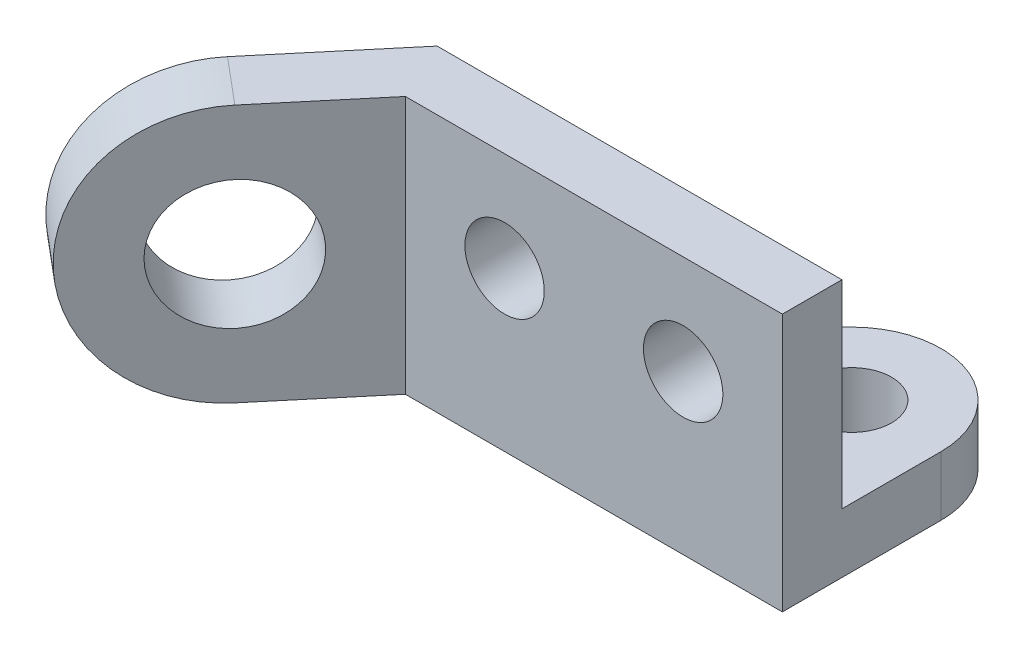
ISO-10303-21;
HEADER;
FILE_DESCRIPTION(('STEP AP214'),'2;1');
FILE_NAME('part.step','',(''),(''),'','','');
FILE_SCHEMA(('AUTOMOTIVE_DESIGN { 1 0 10303 214 1 1 1 1 }'));
ENDSEC;
DATA;
#1=APPLICATION_CONTEXT('core data for automotive mechanical design processes');
#2=APPLICATION_PROTOCOL_DEFINITION('international standard','automotive_design',2000,#1);
#3=PRODUCT_CONTEXT('',#1,'mechanical');
#4=PRODUCT('Part','Part','',(#3));
#5=PRODUCT_RELATED_PRODUCT_CATEGORY('part','',(#4));
#6=PRODUCT_DEFINITION_FORMATION('','',#4);
#7=PRODUCT_DEFINITION_CONTEXT('part definition',#1,'design');
#8=PRODUCT_DEFINITION('design','',#6,#7);
#9=PRODUCT_DEFINITION_SHAPE('','',#8);
#10=(LENGTH_UNIT() NAMED_UNIT(*) SI_UNIT(.MILLI.,.METRE.));
#11=(NAMED_UNIT(*) PLANE_ANGLE_UNIT() SI_UNIT($,.RADIAN.));
#12=(NAMED_UNIT(*) SI_UNIT($,.STERADIAN.) SOLID_ANGLE_UNIT());
#13=UNCERTAINTY_MEASURE_WITH_UNIT(LENGTH_MEASURE(1.E-05),#10,'distance_accuracy_value','');
#14=(GEOMETRIC_REPRESENTATION_CONTEXT(3) GLOBAL_UNCERTAINTY_ASSIGNED_CONTEXT((#13)) GLOBAL_UNIT_ASSIGNED_CONTEXT((#10,
#11,#12)) REPRESENTATION_CONTEXT('',''));
#15=CARTESIAN_POINT('',(0.,0.,0.));
#16=DIRECTION('',(0.,0.,1.));
#17=DIRECTION('',(1.,0.,0.));
#18=AXIS2_PLACEMENT_3D('',#15,#16,#17);
#19=CARTESIAN_POINT('',(0.,26.,-6.));
#20=DIRECTION('',(0.,0.,1.));
#21=DIRECTION('',(1.,0.,0.));
#22=AXIS2_PLACEMENT_3D('',#19,#20,#21);
#23=PLANE('',#22);
#24=CARTESIAN_POINT('',(-28.,16.,-6.));
#25=DIRECTION('',(0.,0.,-1.));
#26=DIRECTION('',(-1.,0.,0.));
#27=AXIS2_PLACEMENT_3D('',#24,#25,#26);
#28=CIRCLE('',#27,4.);
#29=CARTESIAN_POINT('',(-32.,16.,-6.));
#30=VERTEX_POINT('',#29);
#31=EDGE_CURVE('E155',#30,#30,#28,.T.);
#32=ORIENTED_EDGE('',*,*,#31,.F.);
#33=EDGE_LOOP('',(#32));
#34=FACE_BOUND('',#33,.T.);
#35=CARTESIAN_POINT('',(-10.,16.,-6.));
#36=DIRECTION('',(0.,0.,-1.));
#37=DIRECTION('',(-1.,0.,0.));
#38=AXIS2_PLACEMENT_3D('',#35,#36,#37);
#39=CIRCLE('',#38,4.);
#40=CARTESIAN_POINT('',(-14.,16.,-6.));
#41=VERTEX_POINT('',#40);
#42=EDGE_CURVE('E160',#41,#41,#39,.T.);
#43=ORIENTED_EDGE('',*,*,#42,.F.);
#44=EDGE_LOOP('',(#43));
#45=FACE_BOUND('',#44,.T.);
#46=DIRECTION('',(1.,0.,0.));
#47=VECTOR('',#46,1.);
#48=CARTESIAN_POINT('',(0.,6.,-6.));
#49=LINE('',#48,#47);
#50=CARTESIAN_POINT('',(-32.,6.,-6.));
#51=VERTEX_POINT('',#50);
#52=CARTESIAN_POINT('',(0.,6.,-6.));
#53=VERTEX_POINT('',#52);
#54=EDGE_CURVE('E146',#51,#53,#49,.T.);
#55=ORIENTED_EDGE('',*,*,#54,.F.);
#56=DIRECTION('',(0.,-1.,0.));
#57=VECTOR('',#56,1.);
#58=CARTESIAN_POINT('',(-32.,6.,-6.));
#59=LINE('',#58,#57);
#60=CARTESIAN_POINT('',(-32.,0.,-6.));
#61=VERTEX_POINT('',#60);
#62=EDGE_CURVE('E162',#51,#61,#59,.T.);
#63=ORIENTED_EDGE('',*,*,#62,.T.);
#64=DIRECTION('',(-1.,0.,0.));
#65=VECTOR('',#64,1.);
#66=CARTESIAN_POINT('',(0.,0.,-6.));
#67=LINE('',#66,#65);
#68=CARTESIAN_POINT('',(-40.79784594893,0.,-6.));
#69=VERTEX_POINT('',#68);
#70=EDGE_CURVE('E204',#61,#69,#67,.T.);
#71=ORIENTED_EDGE('',*,*,#70,.T.);
#72=DIRECTION('',(0.,-1.,0.));
#73=VECTOR('',#72,1.);
#74=CARTESIAN_POINT('',(-40.79784594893,26.,-6.));
#75=LINE('',#74,#73);
#76=CARTESIAN_POINT('',(-40.79784594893,26.,-6.));
#77=VERTEX_POINT('',#76);
#78=EDGE_CURVE('E220',#77,#69,#75,.T.);
#79=ORIENTED_EDGE('',*,*,#78,.F.);
#80=DIRECTION('',(-1.,0.,0.));
#81=VECTOR('',#80,1.);
#82=CARTESIAN_POINT('',(0.,26.,-6.));
#83=LINE('',#82,#81);
#84=CARTESIAN_POINT('',(0.,26.,-6.));
#85=VERTEX_POINT('',#84);
#86=EDGE_CURVE('E98',#85,#77,#83,.T.);
#87=ORIENTED_EDGE('',*,*,#86,.F.);
#88=DIRECTION('',(0.,-1.,0.));
#89=VECTOR('',#88,1.);
#90=CARTESIAN_POINT('',(0.,26.,-6.));
#91=LINE('',#90,#89);
#92=EDGE_CURVE('E55',#85,#53,#91,.T.);
#93=ORIENTED_EDGE('',*,*,#92,.T.);
#94=EDGE_LOOP('',(#55,#63,#71,#79,#87,#93));
#95=FACE_BOUND('',#94,.T.);
#96=ADVANCED_FACE('F45',(#34,#45,#95),#23,.F.);
#97=CARTESIAN_POINT('',(0.,26.,0.));
#98=DIRECTION('',(-1.,0.,0.));
#99=DIRECTION('',(0.,0.,1.));
#100=AXIS2_PLACEMENT_3D('',#97,#98,#99);
#101=PLANE('',#100);
#102=DIRECTION('',(0.,0.,-1.));
#103=VECTOR('',#102,1.);
#104=CARTESIAN_POINT('',(0.,0.,0.));
#105=LINE('',#104,#103);
#106=CARTESIAN_POINT('',(0.,0.,0.));
#107=VERTEX_POINT('',#106);
#108=CARTESIAN_POINT('',(0.,0.,-16.));
#109=VERTEX_POINT('',#108);
#110=EDGE_CURVE('E152',#107,#109,#105,.T.);
#111=ORIENTED_EDGE('',*,*,#110,.T.);
#112=DIRECTION('',(0.,-1.,0.));
#113=VECTOR('',#112,1.);
#114=CARTESIAN_POINT('',(0.,6.,-16.));
#115=LINE('',#114,#113);
#116=CARTESIAN_POINT('',(0.,6.,-16.));
#117=VERTEX_POINT('',#116);
#118=EDGE_CURVE('E135',#117,#109,#115,.T.);
#119=ORIENTED_EDGE('',*,*,#118,.F.);
#120=DIRECTION('',(0.,0.,-1.));
#121=VECTOR('',#120,1.);
#122=CARTESIAN_POINT('',(0.,6.,-6.));
#123=LINE('',#122,#121);
#124=EDGE_CURVE('E141',#53,#117,#123,.T.);
#125=ORIENTED_EDGE('',*,*,#124,.F.);
#126=ORIENTED_EDGE('',*,*,#92,.F.);
#127=DIRECTION('',(0.,0.,-1.));
#128=VECTOR('',#127,1.);
#129=CARTESIAN_POINT('',(0.,26.,0.));
#130=LINE('',#129,#128);
#131=CARTESIAN_POINT('',(0.,26.,0.));
#132=VERTEX_POINT('',#131);
#133=EDGE_CURVE('E188',#132,#85,#130,.T.);
#134=ORIENTED_EDGE('',*,*,#133,.F.);
#135=DIRECTION('',(0.,-1.,0.));
#136=VECTOR('',#135,1.);
#137=CARTESIAN_POINT('',(0.,26.,0.));
#138=LINE('',#137,#136);
#139=EDGE_CURVE('E201',#132,#107,#138,.T.);
#140=ORIENTED_EDGE('',*,*,#139,.T.);
#141=EDGE_LOOP('',(#111,#119,#125,#126,#134,#140));
#142=FACE_BOUND('',#141,.T.);
#143=ADVANCED_FACE('F47',(#142),#101,.F.);
#144=CARTESIAN_POINT('',(-52.238080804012,26.,7.63394098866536));
#145=DIRECTION('',(0.766044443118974,0.,0.642787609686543));
#146=DIRECTION('',(0.642787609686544,0.,-0.766044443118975));
#147=AXIS2_PLACEMENT_3D('',#144,#145,#146);
#148=PLANE('',#147);
#149=CARTESIAN_POINT('',(-50.4396600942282,13.,5.4906666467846));
#150=DIRECTION('',(-0.766044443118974,0.,-0.642787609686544));
#151=DIRECTION('',(-0.642787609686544,0.,0.766044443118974));
#152=AXIS2_PLACEMENT_3D('',#149,#150,#151);
#153=CIRCLE('',#152,6.5);
#154=CARTESIAN_POINT('',(-54.6177795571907,13.,10.4699555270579));
#155=VERTEX_POINT('',#154);
#156=EDGE_CURVE('E170',#155,#155,#153,.T.);
#157=ORIENTED_EDGE('',*,*,#156,.F.);
#158=EDGE_LOOP('',(#157));
#159=FACE_BOUND('',#158,.T.);
#160=DIRECTION('',(-0.642787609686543,0.,0.766044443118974));
#161=VECTOR('',#160,1.);
#162=CARTESIAN_POINT('',(-52.238080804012,0.,7.63394098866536));
#163=LINE('',#162,#161);
#164=CARTESIAN_POINT('',(-50.4396600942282,0.,5.4906666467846));
#165=VERTEX_POINT('',#164);
#166=EDGE_CURVE('E207',#69,#165,#163,.T.);
#167=ORIENTED_EDGE('',*,*,#166,.T.);
#168=CARTESIAN_POINT('',(-50.4396600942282,13.,5.4906666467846));
#169=DIRECTION('',(-0.766044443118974,0.,-0.642787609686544));
#170=DIRECTION('',(-0.642787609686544,0.,0.766044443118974));
#171=AXIS2_PLACEMENT_3D('',#168,#169,#170);
#172=CIRCLE('',#171,13.);
#173=CARTESIAN_POINT('',(-50.4396600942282,26.,5.4906666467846));
#174=VERTEX_POINT('',#173);
#175=EDGE_CURVE('E181',#165,#174,#172,.T.);
#176=ORIENTED_EDGE('',*,*,#175,.T.);
#177=DIRECTION('',(-0.642787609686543,0.,0.766044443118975));
#178=VECTOR('',#177,1.);
#179=CARTESIAN_POINT('',(-42.5962666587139,26.,-3.85672565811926));
#180=LINE('',#179,#178);
#181=EDGE_CURVE('E193',#77,#174,#180,.T.);
#182=ORIENTED_EDGE('',*,*,#181,.F.);
#183=ORIENTED_EDGE('',*,*,#78,.T.);
#184=EDGE_LOOP('',(#167,#176,#182,#183));
#185=FACE_BOUND('',#184,.T.);
#186=ADVANCED_FACE('F257',(#159,#185),#148,.F.);
#187=CARTESIAN_POINT('',(-38.,26.,0.));
#188=DIRECTION('',(-0.766044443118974,0.,-0.642787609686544));
#189=DIRECTION('',(-0.642787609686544,0.,0.766044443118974));
#190=AXIS2_PLACEMENT_3D('',#187,#188,#189);
#191=PLANE('',#190);
#192=CARTESIAN_POINT('',(-45.8433934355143,13.,9.34739230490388));
#193=DIRECTION('',(-0.766044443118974,0.,-0.642787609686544));
#194=DIRECTION('',(-0.642787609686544,0.,0.766044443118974));
#195=AXIS2_PLACEMENT_3D('',#192,#193,#194);
#196=CIRCLE('',#195,6.5);
#197=CARTESIAN_POINT('',(-50.0215128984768,13.,14.3266811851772));
#198=VERTEX_POINT('',#197);
#199=EDGE_CURVE('E174',#198,#198,#196,.T.);
#200=ORIENTED_EDGE('',*,*,#199,.T.);
#201=EDGE_LOOP('',(#200));
#202=FACE_BOUND('',#201,.T.);
#203=DIRECTION('',(0.642787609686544,0.,-0.766044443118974));
#204=VECTOR('',#203,1.);
#205=CARTESIAN_POINT('',(-38.,26.,0.));
#206=LINE('',#205,#204);
#207=CARTESIAN_POINT('',(-45.8433934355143,26.,9.34739230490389));
#208=VERTEX_POINT('',#207);
#209=CARTESIAN_POINT('',(-38.,26.,0.));
#210=VERTEX_POINT('',#209);
#211=EDGE_CURVE('E196',#208,#210,#206,.T.);
#212=ORIENTED_EDGE('',*,*,#211,.F.);
#213=CARTESIAN_POINT('',(-45.8433934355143,13.,9.34739230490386));
#214=DIRECTION('',(-0.766044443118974,0.,-0.642787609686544));
#215=DIRECTION('',(-0.642787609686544,0.,0.766044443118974));
#216=AXIS2_PLACEMENT_3D('',#213,#214,#215);
#217=CIRCLE('',#216,13.);
#218=CARTESIAN_POINT('',(-45.8433934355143,0.,9.34739230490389));
#219=VERTEX_POINT('',#218);
#220=EDGE_CURVE('E176',#219,#208,#217,.T.);
#221=ORIENTED_EDGE('',*,*,#220,.F.);
#222=DIRECTION('',(0.642787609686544,0.,-0.766044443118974));
#223=VECTOR('',#222,1.);
#224=CARTESIAN_POINT('',(-38.,0.,0.));
#225=LINE('',#224,#223);
#226=CARTESIAN_POINT('',(-38.,0.,0.));
#227=VERTEX_POINT('',#226);
#228=EDGE_CURVE('E210',#219,#227,#225,.T.);
#229=ORIENTED_EDGE('',*,*,#228,.T.);
#230=DIRECTION('',(0.,-1.,0.));
#231=VECTOR('',#230,1.);
#232=CARTESIAN_POINT('',(-38.,26.,0.));
#233=LINE('',#232,#231);
#234=EDGE_CURVE('E217',#210,#227,#233,.T.);
#235=ORIENTED_EDGE('',*,*,#234,.F.);
#236=EDGE_LOOP('',(#212,#221,#229,#235));
#237=FACE_BOUND('',#236,.T.);
#238=ADVANCED_FACE('F263',(#202,#237),#191,.F.);
#239=CARTESIAN_POINT('',(0.,26.,0.));
#240=DIRECTION('',(0.,0.,-1.));
#241=DIRECTION('',(-1.,0.,0.));
#242=AXIS2_PLACEMENT_3D('',#239,#240,#241);
#243=PLANE('',#242);
#244=CARTESIAN_POINT('',(-10.,16.,0.));
#245=DIRECTION('',(0.,0.,-1.));
#246=DIRECTION('',(-1.,0.,0.));
#247=AXIS2_PLACEMENT_3D('',#244,#245,#246);
#248=CIRCLE('',#247,4.);
#249=CARTESIAN_POINT('',(-14.,16.,0.));
#250=VERTEX_POINT('',#249);
#251=EDGE_CURVE('E175',#250,#250,#248,.T.);
#252=ORIENTED_EDGE('',*,*,#251,.T.);
#253=EDGE_LOOP('',(#252));
#254=FACE_BOUND('',#253,.T.);
#255=CARTESIAN_POINT('',(-28.,16.,0.));
#256=DIRECTION('',(0.,0.,-1.));
#257=DIRECTION('',(-1.,0.,0.));
#258=AXIS2_PLACEMENT_3D('',#255,#256,#257);
#259=CIRCLE('',#258,4.);
#260=CARTESIAN_POINT('',(-32.,16.,0.));
#261=VERTEX_POINT('',#260);
#262=EDGE_CURVE('E168',#261,#261,#259,.T.);
#263=ORIENTED_EDGE('',*,*,#262,.T.);
#264=EDGE_LOOP('',(#263));
#265=FACE_BOUND('',#264,.T.);
#266=DIRECTION('',(1.,0.,0.));
#267=VECTOR('',#266,1.);
#268=CARTESIAN_POINT('',(0.,0.,0.));
#269=LINE('',#268,#267);
#270=EDGE_CURVE('E90',#227,#107,#269,.T.);
#271=ORIENTED_EDGE('',*,*,#270,.T.);
#272=ORIENTED_EDGE('',*,*,#139,.F.);
#273=DIRECTION('',(1.,0.,0.));
#274=VECTOR('',#273,1.);
#275=CARTESIAN_POINT('',(0.,26.,0.));
#276=LINE('',#275,#274);
#277=EDGE_CURVE('E72',#210,#132,#276,.T.);
#278=ORIENTED_EDGE('',*,*,#277,.F.);
#279=ORIENTED_EDGE('',*,*,#234,.T.);
#280=EDGE_LOOP('',(#271,#272,#278,#279));
#281=FACE_BOUND('',#280,.T.);
#282=ADVANCED_FACE('F235',(#254,#265,#281),#243,.F.);
#283=CARTESIAN_POINT('',(0.,26.,0.));
#284=DIRECTION('',(0.,1.,0.));
#285=DIRECTION('',(0.,0.,1.));
#286=AXIS2_PLACEMENT_3D('',#283,#284,#285);
#287=PLANE('',#286);
#288=DIRECTION('',(-0.766044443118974,0.,-0.642787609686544));
#289=VECTOR('',#288,1.);
#290=CARTESIAN_POINT('',(-17.8860292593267,26.,32.8064062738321));
#291=LINE('',#290,#289);
#292=EDGE_CURVE('E180',#208,#174,#291,.T.);
#293=ORIENTED_EDGE('',*,*,#292,.F.);
#294=ORIENTED_EDGE('',*,*,#211,.T.);
#295=ORIENTED_EDGE('',*,*,#277,.T.);
#296=ORIENTED_EDGE('',*,*,#133,.T.);
#297=ORIENTED_EDGE('',*,*,#86,.T.);
#298=ORIENTED_EDGE('',*,*,#181,.T.);
#299=EDGE_LOOP('',(#293,#294,#295,#296,#297,#298));
#300=FACE_BOUND('',#299,.T.);
#301=ADVANCED_FACE('F270',(#300),#287,.T.);
#302=CARTESIAN_POINT('',(0.,0.,0.));
#303=DIRECTION('',(0.,1.,0.));
#304=DIRECTION('',(0.,0.,1.));
#305=AXIS2_PLACEMENT_3D('',#302,#303,#304);
#306=PLANE('',#305);
#307=CARTESIAN_POINT('',(-9.,0.,-16.));
#308=DIRECTION('',(0.,-1.,0.));
#309=DIRECTION('',(0.,0.,-1.));
#310=AXIS2_PLACEMENT_3D('',#307,#308,#309);
#311=CIRCLE('',#310,4.);
#312=CARTESIAN_POINT('',(-9.,0.,-20.));
#313=VERTEX_POINT('',#312);
#314=EDGE_CURVE('E311',#313,#313,#311,.T.);
#315=ORIENTED_EDGE('',*,*,#314,.F.);
#316=EDGE_LOOP('',(#315));
#317=FACE_BOUND('',#316,.T.);
#318=ORIENTED_EDGE('',*,*,#228,.F.);
#319=DIRECTION('',(-0.766044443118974,0.,-0.642787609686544));
#320=VECTOR('',#319,1.);
#321=CARTESIAN_POINT('',(-23.5440780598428,0.,28.0587396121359));
#322=LINE('',#321,#320);
#323=EDGE_CURVE('E11',#219,#165,#322,.T.);
#324=ORIENTED_EDGE('',*,*,#323,.T.);
#325=ORIENTED_EDGE('',*,*,#166,.F.);
#326=ORIENTED_EDGE('',*,*,#70,.F.);
#327=DIRECTION('',(-0.712903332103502,0.,0.70126231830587));
#328=VECTOR('',#327,1.);
#329=CARTESIAN_POINT('',(-32.,0.,-6.));
#330=LINE('',#329,#328);
#331=CARTESIAN_POINT('',(-15.3113608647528,0.,-22.4161299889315));
#332=VERTEX_POINT('',#331);
#333=EDGE_CURVE('E63',#332,#61,#330,.T.);
#334=ORIENTED_EDGE('',*,*,#333,.F.);
#335=CARTESIAN_POINT('',(-9.,0.,-16.));
#336=DIRECTION('',(0.,1.,0.));
#337=DIRECTION('',(0.,0.,1.));
#338=AXIS2_PLACEMENT_3D('',#335,#336,#337);
#339=CIRCLE('',#338,9.);
#340=EDGE_CURVE('E300',#109,#332,#339,.T.);
#341=ORIENTED_EDGE('',*,*,#340,.F.);
#342=ORIENTED_EDGE('',*,*,#110,.F.);
#343=ORIENTED_EDGE('',*,*,#270,.F.);
#344=EDGE_LOOP('',(#318,#324,#325,#326,#334,#341,#342,#343));
#345=FACE_BOUND('',#344,.T.);
#346=ADVANCED_FACE('F271',(#317,#345),#306,.F.);
#347=CARTESIAN_POINT('',(-45.8433934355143,13.,9.34739230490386));
#348=DIRECTION('',(-0.766044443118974,0.,-0.642787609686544));
#349=DIRECTION('',(-0.642787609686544,0.,0.766044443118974));
#350=AXIS2_PLACEMENT_3D('',#347,#348,#349);
#351=CYLINDRICAL_SURFACE('',#350,13.);
#352=ORIENTED_EDGE('',*,*,#175,.F.);
#353=ORIENTED_EDGE('',*,*,#323,.F.);
#354=ORIENTED_EDGE('',*,*,#220,.T.);
#355=ORIENTED_EDGE('',*,*,#292,.T.);
#356=EDGE_LOOP('',(#352,#353,#354,#355));
#357=FACE_BOUND('',#356,.T.);
#358=ADVANCED_FACE('F274',(#357),#351,.T.);
#359=CARTESIAN_POINT('',(-14.0377435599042,13.,36.0355013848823));
#360=DIRECTION('',(-0.766044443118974,0.,-0.642787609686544));
#361=DIRECTION('',(-0.642787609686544,0.,0.766044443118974));
#362=AXIS2_PLACEMENT_3D('',#359,#360,#361);
#363=CYLINDRICAL_SURFACE('',#362,6.5);
#364=ORIENTED_EDGE('',*,*,#156,.T.);
#365=EDGE_LOOP('',(#364));
#366=FACE_BOUND('',#365,.T.);
#367=ORIENTED_EDGE('',*,*,#199,.F.);
#368=EDGE_LOOP('',(#367));
#369=FACE_BOUND('',#368,.T.);
#370=ADVANCED_FACE('F250',(#366,#369),#363,.F.);
#371=CARTESIAN_POINT('',(-28.,16.,19.3059700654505));
#372=DIRECTION('',(0.,0.,-1.));
#373=DIRECTION('',(-1.,0.,0.));
#374=AXIS2_PLACEMENT_3D('',#371,#372,#373);
#375=CYLINDRICAL_SURFACE('',#374,4.);
#376=ORIENTED_EDGE('',*,*,#31,.T.);
#377=EDGE_LOOP('',(#376));
#378=FACE_BOUND('',#377,.T.);
#379=ORIENTED_EDGE('',*,*,#262,.F.);
#380=EDGE_LOOP('',(#379));
#381=FACE_BOUND('',#380,.T.);
#382=ADVANCED_FACE('F240',(#378,#381),#375,.F.);
#383=CARTESIAN_POINT('',(-10.,16.,19.3059700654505));
#384=DIRECTION('',(0.,0.,-1.));
#385=DIRECTION('',(-1.,0.,0.));
#386=AXIS2_PLACEMENT_3D('',#383,#384,#385);
#387=CYLINDRICAL_SURFACE('',#386,4.);
#388=ORIENTED_EDGE('',*,*,#42,.T.);
#389=EDGE_LOOP('',(#388));
#390=FACE_BOUND('',#389,.T.);
#391=ORIENTED_EDGE('',*,*,#251,.F.);
#392=EDGE_LOOP('',(#391));
#393=FACE_BOUND('',#392,.T.);
#394=ADVANCED_FACE('F238',(#390,#393),#387,.F.);
#395=CARTESIAN_POINT('',(-9.,6.,-16.));
#396=DIRECTION('',(0.,-1.,0.));
#397=DIRECTION('',(0.,0.,-1.));
#398=AXIS2_PLACEMENT_3D('',#395,#396,#397);
#399=CYLINDRICAL_SURFACE('',#398,9.);
#400=ORIENTED_EDGE('',*,*,#340,.T.);
#401=DIRECTION('',(0.,-1.,0.));
#402=VECTOR('',#401,1.);
#403=CARTESIAN_POINT('',(-15.3113608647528,6.,-22.4161299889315));
#404=LINE('',#403,#402);
#405=CARTESIAN_POINT('',(-15.3113608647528,6.,-22.4161299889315));
#406=VERTEX_POINT('',#405);
#407=EDGE_CURVE('E136',#406,#332,#404,.T.);
#408=ORIENTED_EDGE('',*,*,#407,.F.);
#409=CARTESIAN_POINT('',(-9.,6.,-16.));
#410=DIRECTION('',(0.,1.,0.));
#411=DIRECTION('',(0.,0.,1.));
#412=AXIS2_PLACEMENT_3D('',#409,#410,#411);
#413=CIRCLE('',#412,9.);
#414=EDGE_CURVE('E131',#117,#406,#413,.T.);
#415=ORIENTED_EDGE('',*,*,#414,.F.);
#416=ORIENTED_EDGE('',*,*,#118,.T.);
#417=EDGE_LOOP('',(#400,#408,#415,#416));
#418=FACE_BOUND('',#417,.T.);
#419=ADVANCED_FACE('F133',(#418),#399,.T.);
#420=CARTESIAN_POINT('',(-32.,6.,-6.));
#421=DIRECTION('',(0.70126231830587,0.,0.712903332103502));
#422=DIRECTION('',(0.712903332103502,0.,-0.70126231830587));
#423=AXIS2_PLACEMENT_3D('',#420,#421,#422);
#424=PLANE('',#423);
#425=ORIENTED_EDGE('',*,*,#333,.T.);
#426=ORIENTED_EDGE('',*,*,#62,.F.);
#427=DIRECTION('',(-0.712903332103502,0.,0.70126231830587));
#428=VECTOR('',#427,1.);
#429=CARTESIAN_POINT('',(-32.,6.,-6.));
#430=LINE('',#429,#428);
#431=EDGE_CURVE('E140',#406,#51,#430,.T.);
#432=ORIENTED_EDGE('',*,*,#431,.F.);
#433=ORIENTED_EDGE('',*,*,#407,.T.);
#434=EDGE_LOOP('',(#425,#426,#432,#433));
#435=FACE_BOUND('',#434,.T.);
#436=ADVANCED_FACE('F248',(#435),#424,.F.);
#437=CARTESIAN_POINT('',(-9.,6.,-16.));
#438=DIRECTION('',(0.,1.,0.));
#439=DIRECTION('',(0.,0.,1.));
#440=AXIS2_PLACEMENT_3D('',#437,#438,#439);
#441=PLANE('',#440);
#442=CARTESIAN_POINT('',(-9.,6.,-16.));
#443=DIRECTION('',(0.,1.,0.));
#444=DIRECTION('',(0.,0.,1.));
#445=AXIS2_PLACEMENT_3D('',#442,#443,#444);
#446=CIRCLE('',#445,4.);
#447=CARTESIAN_POINT('',(-9.,6.,-12.));
#448=VERTEX_POINT('',#447);
#449=EDGE_CURVE('E49',#448,#448,#446,.T.);
#450=ORIENTED_EDGE('',*,*,#449,.F.);
#451=EDGE_LOOP('',(#450));
#452=FACE_BOUND('',#451,.T.);
#453=ORIENTED_EDGE('',*,*,#124,.T.);
#454=ORIENTED_EDGE('',*,*,#414,.T.);
#455=ORIENTED_EDGE('',*,*,#431,.T.);
#456=ORIENTED_EDGE('',*,*,#54,.T.);
#457=EDGE_LOOP('',(#453,#454,#455,#456));
#458=FACE_BOUND('',#457,.T.);
#459=ADVANCED_FACE('F144',(#452,#458),#441,.T.);
#460=CARTESIAN_POINT('',(-9.,26.,-16.));
#461=DIRECTION('',(0.,-1.,0.));
#462=DIRECTION('',(0.,0.,-1.));
#463=AXIS2_PLACEMENT_3D('',#460,#461,#462);
#464=CYLINDRICAL_SURFACE('',#463,4.);
#465=ORIENTED_EDGE('',*,*,#449,.T.);
#466=EDGE_LOOP('',(#465));
#467=FACE_BOUND('',#466,.T.);
#468=ORIENTED_EDGE('',*,*,#314,.T.);
#469=EDGE_LOOP('',(#468));
#470=FACE_BOUND('',#469,.T.);
#471=ADVANCED_FACE('F320',(#467,#470),#464,.F.);
#472=CLOSED_SHELL('',(#96,#143,#186,#238,#282,#301,#346,#358,#370,#382,#394,#419,#436,#459,#471));
#473=MANIFOLD_SOLID_BREP('B2',#472);
#474=ADVANCED_BREP_SHAPE_REPRESENTATION('',(#18,#473),#14);
#475=SHAPE_DEFINITION_REPRESENTATION(#9,#474);
ENDSEC;
END-ISO-10303-21;
